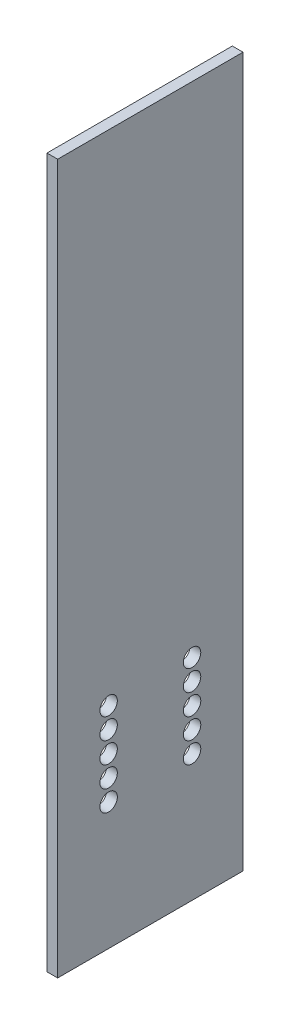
from build123d import *

# Parameters (mm, degrees)
SKETCH1_W                  = 56.4388
SKETCH1_H                  = 287.02
BOSS_EXTRUDE1_DEPTH        = 3.2512
F_4_0_209_DIAMETER_HOLE1_D = 5.3086
CUT_EXTRUDE1_REACH         = 148.294
SKETCH5_W                  = 56.4388
SKETCH5_H                  = 71.12
LPATTERN1_COUNT            = 4
LPATTERN1_PITCH            = 6.35
LPATTERN1_COL_COUNT        = 2
LPATTERN1_COL_PITCH        = 6.35


with BuildPart() as part:
    # Sketch1 → Boss-Extrude1 (new body)
    with BuildSketch(Plane(origin=(0, 0, 0), x_dir=(0, 0, -1), z_dir=(1, 0, 0))):
        Rectangle(SKETCH1_W, SKETCH1_H)
    extrude(amount=BOSS_EXTRUDE1_DEPTH)

    # 4 _0.209_ Diameter Hole1 (through all)
    with Locations(Plane.ZY):
        with Locations((-12.7, -98.5012), (12.7, -98.5012)):
            f_4_0_209_diameter_hole1 = Hole(F_4_0_209_DIAMETER_HOLE1_D / 2)

    # Sketch5 → Cut-Extrude1 (cut, up to next)
    with BuildSketch(Plane.ZY, mode=Mode.PRIVATE) as cut_extrude1_sk1:
        with Locations((0, 107.95)):
            Rectangle(SKETCH5_W, SKETCH5_H)
    cut_extrude1_tool1 = extrude(cut_extrude1_sk1.sketch, amount=-CUT_EXTRUDE1_REACH, mode=Mode.PRIVATE) & part.part
    add(cut_extrude1_tool1.solids().sort_by_distance((0, 107.95, 0))[0], mode=Mode.SUBTRACT)

    # LPattern1: 4 _0.209_ Diameter Hole1 ×4
    with Locations(*[(0, i * LPATTERN1_PITCH, 0) for i in range(1, LPATTERN1_COUNT)]):
        add(f_4_0_209_diameter_hole1, mode=Mode.SUBTRACT)

    # LPattern1 col: 4 _0.209_ Diameter Hole1 ×2
    with Locations(*[(0, -i * LPATTERN1_COL_PITCH, 0) for i in range(1, LPATTERN1_COL_COUNT)]):
        add(f_4_0_209_diameter_hole1, mode=Mode.SUBTRACT)


solid = part.part
